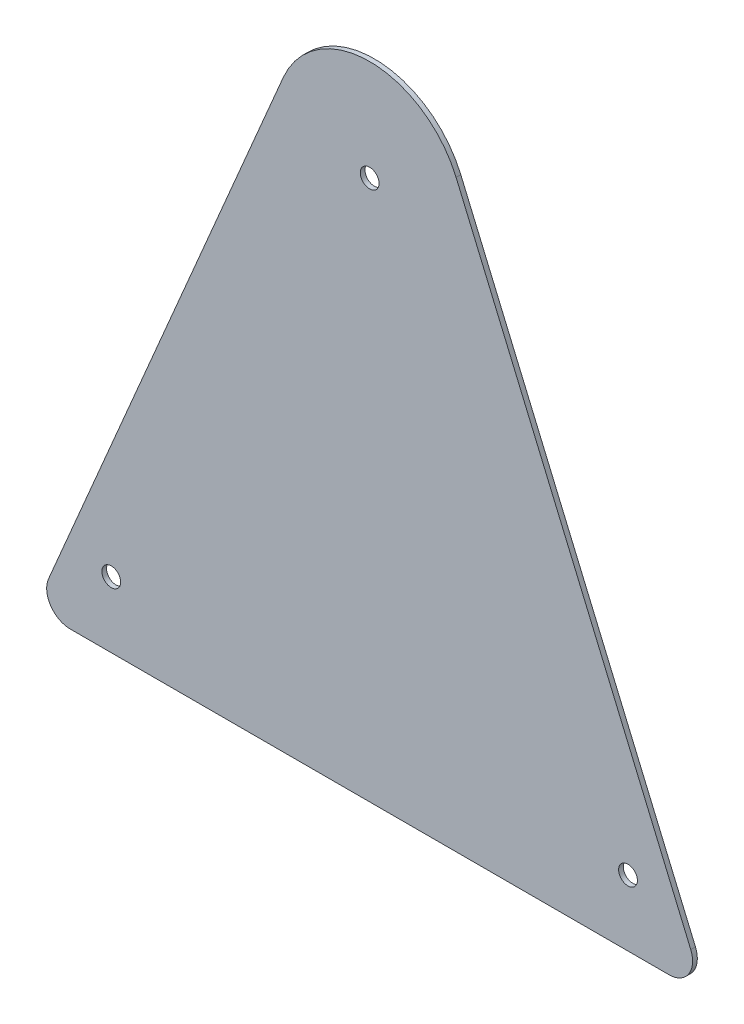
ISO-10303-21;
HEADER;
FILE_DESCRIPTION(('STEP AP214'),'2;1');
FILE_NAME('part.step','',(''),(''),'','','');
FILE_SCHEMA(('AUTOMOTIVE_DESIGN { 1 0 10303 214 1 1 1 1 }'));
ENDSEC;
DATA;
#1=APPLICATION_CONTEXT('core data for automotive mechanical design processes');
#2=APPLICATION_PROTOCOL_DEFINITION('international standard','automotive_design',2000,#1);
#3=PRODUCT_CONTEXT('',#1,'mechanical');
#4=PRODUCT('Part','Part','',(#3));
#5=PRODUCT_RELATED_PRODUCT_CATEGORY('part','',(#4));
#6=PRODUCT_DEFINITION_FORMATION('','',#4);
#7=PRODUCT_DEFINITION_CONTEXT('part definition',#1,'design');
#8=PRODUCT_DEFINITION('design','',#6,#7);
#9=PRODUCT_DEFINITION_SHAPE('','',#8);
#10=(LENGTH_UNIT() NAMED_UNIT(*) SI_UNIT(.MILLI.,.METRE.));
#11=(NAMED_UNIT(*) PLANE_ANGLE_UNIT() SI_UNIT($,.RADIAN.));
#12=(NAMED_UNIT(*) SI_UNIT($,.STERADIAN.) SOLID_ANGLE_UNIT());
#13=UNCERTAINTY_MEASURE_WITH_UNIT(LENGTH_MEASURE(1.E-05),#10,'distance_accuracy_value','');
#14=(GEOMETRIC_REPRESENTATION_CONTEXT(3) GLOBAL_UNCERTAINTY_ASSIGNED_CONTEXT((#13)) GLOBAL_UNIT_ASSIGNED_CONTEXT((#10,
#11,#12)) REPRESENTATION_CONTEXT('',''));
#15=CARTESIAN_POINT('',(0.,0.,0.));
#16=DIRECTION('',(0.,0.,1.));
#17=DIRECTION('',(1.,0.,0.));
#18=AXIS2_PLACEMENT_3D('',#15,#16,#17);
#19=CARTESIAN_POINT('',(-127.5,10.,-1.));
#20=DIRECTION('',(0.,0.,-1.));
#21=DIRECTION('',(-1.,0.,0.));
#22=AXIS2_PLACEMENT_3D('',#19,#20,#21);
#23=PLANE('',#22);
#24=CARTESIAN_POINT('',(-110.,28.0099012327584,-1.));
#25=DIRECTION('',(0.,0.,1.));
#26=DIRECTION('',(1.,0.,0.));
#27=AXIS2_PLACEMENT_3D('',#24,#25,#26);
#28=CIRCLE('',#27,4.00000000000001);
#29=CARTESIAN_POINT('',(-106.,28.0099012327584,-1.));
#30=VERTEX_POINT('',#29);
#31=EDGE_CURVE('E157',#30,#30,#28,.T.);
#32=ORIENTED_EDGE('',*,*,#31,.T.);
#33=EDGE_LOOP('',(#32));
#34=FACE_BOUND('',#33,.T.);
#35=CARTESIAN_POINT('',(-127.5,10.,-1.));
#36=DIRECTION('',(0.,0.,-1.));
#37=DIRECTION('',(-1.,0.,0.));
#38=AXIS2_PLACEMENT_3D('',#35,#36,#37);
#39=CIRCLE('',#38,9.99999999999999);
#40=CARTESIAN_POINT('',(-127.5,0.,-1.));
#41=VERTEX_POINT('',#40);
#42=CARTESIAN_POINT('',(-136.701501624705,13.9156567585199,-1.));
#43=VERTEX_POINT('',#42);
#44=EDGE_CURVE('E84',#41,#43,#39,.T.);
#45=ORIENTED_EDGE('',*,*,#44,.T.);
#46=DIRECTION('',(-0.391565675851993,-0.920150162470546,0.));
#47=VECTOR('',#46,1.);
#48=CARTESIAN_POINT('',(-36.8060064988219,248.66262703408,-1.));
#49=LINE('',#48,#47);
#50=CARTESIAN_POINT('',(-36.8060064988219,248.66262703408,-1.));
#51=VERTEX_POINT('',#50);
#52=EDGE_CURVE('E91',#51,#43,#49,.T.);
#53=ORIENTED_EDGE('',*,*,#52,.F.);
#54=CARTESIAN_POINT('',(0.,233.,-1.));
#55=DIRECTION('',(0.,0.,1.));
#56=DIRECTION('',(1.,0.,0.));
#57=AXIS2_PLACEMENT_3D('',#54,#55,#56);
#58=CIRCLE('',#57,40.);
#59=CARTESIAN_POINT('',(36.8060064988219,248.66262703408,-1.));
#60=VERTEX_POINT('',#59);
#61=EDGE_CURVE('E96',#60,#51,#58,.T.);
#62=ORIENTED_EDGE('',*,*,#61,.F.);
#63=DIRECTION('',(-0.391565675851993,0.920150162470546,0.));
#64=VECTOR('',#63,1.);
#65=CARTESIAN_POINT('',(136.701501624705,13.9156567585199,-1.));
#66=LINE('',#65,#64);
#67=CARTESIAN_POINT('',(136.701501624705,13.9156567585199,-1.));
#68=VERTEX_POINT('',#67);
#69=EDGE_CURVE('E110',#68,#60,#66,.T.);
#70=ORIENTED_EDGE('',*,*,#69,.F.);
#71=CARTESIAN_POINT('',(127.5,10.,-1.));
#72=DIRECTION('',(0.,0.,1.));
#73=DIRECTION('',(1.,0.,0.));
#74=AXIS2_PLACEMENT_3D('',#71,#72,#73);
#75=CIRCLE('',#74,9.99999999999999);
#76=CARTESIAN_POINT('',(127.5,0.,-1.));
#77=VERTEX_POINT('',#76);
#78=EDGE_CURVE('E112',#77,#68,#75,.T.);
#79=ORIENTED_EDGE('',*,*,#78,.F.);
#80=DIRECTION('',(1.,0.,0.));
#81=VECTOR('',#80,1.);
#82=CARTESIAN_POINT('',(-127.5,0.,-1.));
#83=LINE('',#82,#81);
#84=EDGE_CURVE('E101',#41,#77,#83,.T.);
#85=ORIENTED_EDGE('',*,*,#84,.F.);
#86=EDGE_LOOP('',(#45,#53,#62,#70,#79,#85));
#87=FACE_BOUND('',#86,.T.);
#88=CARTESIAN_POINT('',(0.,230.,-1.));
#89=DIRECTION('',(0.,0.,1.));
#90=DIRECTION('',(1.,0.,0.));
#91=AXIS2_PLACEMENT_3D('',#88,#89,#90);
#92=CIRCLE('',#91,4.);
#93=CARTESIAN_POINT('',(4.,230.,-1.));
#94=VERTEX_POINT('',#93);
#95=EDGE_CURVE('E105',#94,#94,#92,.T.);
#96=ORIENTED_EDGE('',*,*,#95,.T.);
#97=EDGE_LOOP('',(#96));
#98=FACE_BOUND('',#97,.T.);
#99=CARTESIAN_POINT('',(110.,28.0099012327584,-1.));
#100=DIRECTION('',(0.,0.,1.));
#101=DIRECTION('',(1.,0.,0.));
#102=AXIS2_PLACEMENT_3D('',#99,#100,#101);
#103=CIRCLE('',#102,4.00000000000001);
#104=CARTESIAN_POINT('',(114.,28.0099012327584,-1.));
#105=VERTEX_POINT('',#104);
#106=EDGE_CURVE('E158',#105,#105,#103,.T.);
#107=ORIENTED_EDGE('',*,*,#106,.T.);
#108=EDGE_LOOP('',(#107));
#109=FACE_BOUND('',#108,.T.);
#110=ADVANCED_FACE('F30',(#34,#87,#98,#109),#23,.T.);
#111=CARTESIAN_POINT('',(-127.5,10.,1.));
#112=DIRECTION('',(0.,0.,-1.));
#113=DIRECTION('',(-1.,0.,0.));
#114=AXIS2_PLACEMENT_3D('',#111,#112,#113);
#115=PLANE('',#114);
#116=CARTESIAN_POINT('',(-110.,28.0099012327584,1.));
#117=DIRECTION('',(0.,0.,1.));
#118=DIRECTION('',(1.,0.,0.));
#119=AXIS2_PLACEMENT_3D('',#116,#117,#118);
#120=CIRCLE('',#119,4.00000000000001);
#121=CARTESIAN_POINT('',(-106.,28.0099012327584,1.));
#122=VERTEX_POINT('',#121);
#123=EDGE_CURVE('E161',#122,#122,#120,.T.);
#124=ORIENTED_EDGE('',*,*,#123,.F.);
#125=EDGE_LOOP('',(#124));
#126=FACE_BOUND('',#125,.T.);
#127=CARTESIAN_POINT('',(-127.5,10.,1.));
#128=DIRECTION('',(0.,0.,-1.));
#129=DIRECTION('',(-1.,0.,0.));
#130=AXIS2_PLACEMENT_3D('',#127,#128,#129);
#131=CIRCLE('',#130,9.99999999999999);
#132=CARTESIAN_POINT('',(-127.5,0.,1.));
#133=VERTEX_POINT('',#132);
#134=CARTESIAN_POINT('',(-136.701501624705,13.9156567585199,1.));
#135=VERTEX_POINT('',#134);
#136=EDGE_CURVE('E85',#133,#135,#131,.T.);
#137=ORIENTED_EDGE('',*,*,#136,.F.);
#138=DIRECTION('',(1.,0.,0.));
#139=VECTOR('',#138,1.);
#140=CARTESIAN_POINT('',(-127.5,0.,1.));
#141=LINE('',#140,#139);
#142=CARTESIAN_POINT('',(127.5,0.,1.));
#143=VERTEX_POINT('',#142);
#144=EDGE_CURVE('E52',#133,#143,#141,.T.);
#145=ORIENTED_EDGE('',*,*,#144,.T.);
#146=CARTESIAN_POINT('',(127.5,10.,1.));
#147=DIRECTION('',(0.,0.,1.));
#148=DIRECTION('',(1.,0.,0.));
#149=AXIS2_PLACEMENT_3D('',#146,#147,#148);
#150=CIRCLE('',#149,9.99999999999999);
#151=CARTESIAN_POINT('',(136.701501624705,13.9156567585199,1.));
#152=VERTEX_POINT('',#151);
#153=EDGE_CURVE('E122',#143,#152,#150,.T.);
#154=ORIENTED_EDGE('',*,*,#153,.T.);
#155=DIRECTION('',(-0.391565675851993,0.920150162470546,0.));
#156=VECTOR('',#155,1.);
#157=CARTESIAN_POINT('',(136.701501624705,13.9156567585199,1.));
#158=LINE('',#157,#156);
#159=CARTESIAN_POINT('',(36.8060064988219,248.66262703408,1.));
#160=VERTEX_POINT('',#159);
#161=EDGE_CURVE('E120',#152,#160,#158,.T.);
#162=ORIENTED_EDGE('',*,*,#161,.T.);
#163=CARTESIAN_POINT('',(0.,233.,1.));
#164=DIRECTION('',(0.,0.,1.));
#165=DIRECTION('',(1.,0.,0.));
#166=AXIS2_PLACEMENT_3D('',#163,#164,#165);
#167=CIRCLE('',#166,40.);
#168=CARTESIAN_POINT('',(-36.8060064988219,248.66262703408,1.));
#169=VERTEX_POINT('',#168);
#170=EDGE_CURVE('E118',#160,#169,#167,.T.);
#171=ORIENTED_EDGE('',*,*,#170,.T.);
#172=DIRECTION('',(-0.391565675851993,-0.920150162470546,0.));
#173=VECTOR('',#172,1.);
#174=CARTESIAN_POINT('',(-36.8060064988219,248.66262703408,1.));
#175=LINE('',#174,#173);
#176=EDGE_CURVE('E116',#169,#135,#175,.T.);
#177=ORIENTED_EDGE('',*,*,#176,.T.);
#178=EDGE_LOOP('',(#137,#145,#154,#162,#171,#177));
#179=FACE_BOUND('',#178,.T.);
#180=CARTESIAN_POINT('',(0.,230.,1.));
#181=DIRECTION('',(0.,0.,1.));
#182=DIRECTION('',(1.,0.,0.));
#183=AXIS2_PLACEMENT_3D('',#180,#181,#182);
#184=CIRCLE('',#183,4.);
#185=CARTESIAN_POINT('',(4.,230.,1.));
#186=VERTEX_POINT('',#185);
#187=EDGE_CURVE('E102',#186,#186,#184,.T.);
#188=ORIENTED_EDGE('',*,*,#187,.F.);
#189=EDGE_LOOP('',(#188));
#190=FACE_BOUND('',#189,.T.);
#191=CARTESIAN_POINT('',(110.,28.0099012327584,1.));
#192=DIRECTION('',(0.,0.,1.));
#193=DIRECTION('',(1.,0.,0.));
#194=AXIS2_PLACEMENT_3D('',#191,#192,#193);
#195=CIRCLE('',#194,4.00000000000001);
#196=CARTESIAN_POINT('',(114.,28.0099012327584,1.));
#197=VERTEX_POINT('',#196);
#198=EDGE_CURVE('E155',#197,#197,#195,.T.);
#199=ORIENTED_EDGE('',*,*,#198,.F.);
#200=EDGE_LOOP('',(#199));
#201=FACE_BOUND('',#200,.T.);
#202=ADVANCED_FACE('F146',(#126,#179,#190,#201),#115,.F.);
#203=CARTESIAN_POINT('',(-127.5,10.,1.));
#204=DIRECTION('',(0.,0.,-1.));
#205=DIRECTION('',(-1.,0.,0.));
#206=AXIS2_PLACEMENT_3D('',#203,#204,#205);
#207=CYLINDRICAL_SURFACE('',#206,9.99999999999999);
#208=ORIENTED_EDGE('',*,*,#44,.F.);
#209=DIRECTION('',(0.,0.,-1.));
#210=VECTOR('',#209,1.);
#211=CARTESIAN_POINT('',(-127.5,0.,1.));
#212=LINE('',#211,#210);
#213=EDGE_CURVE('E11',#133,#41,#212,.T.);
#214=ORIENTED_EDGE('',*,*,#213,.F.);
#215=ORIENTED_EDGE('',*,*,#136,.T.);
#216=DIRECTION('',(0.,0.,-1.));
#217=VECTOR('',#216,1.);
#218=CARTESIAN_POINT('',(-136.701501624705,13.9156567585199,1.));
#219=LINE('',#218,#217);
#220=EDGE_CURVE('E34',#135,#43,#219,.T.);
#221=ORIENTED_EDGE('',*,*,#220,.T.);
#222=EDGE_LOOP('',(#208,#214,#215,#221));
#223=FACE_BOUND('',#222,.T.);
#224=ADVANCED_FACE('F32',(#223),#207,.T.);
#225=CARTESIAN_POINT('',(-127.5,0.,1.));
#226=DIRECTION('',(0.,1.,0.));
#227=DIRECTION('',(0.,0.,1.));
#228=AXIS2_PLACEMENT_3D('',#225,#226,#227);
#229=PLANE('',#228);
#230=ORIENTED_EDGE('',*,*,#84,.T.);
#231=DIRECTION('',(0.,0.,-1.));
#232=VECTOR('',#231,1.);
#233=CARTESIAN_POINT('',(127.5,0.,1.));
#234=LINE('',#233,#232);
#235=EDGE_CURVE('E39',#143,#77,#234,.T.);
#236=ORIENTED_EDGE('',*,*,#235,.F.);
#237=ORIENTED_EDGE('',*,*,#144,.F.);
#238=ORIENTED_EDGE('',*,*,#213,.T.);
#239=EDGE_LOOP('',(#230,#236,#237,#238));
#240=FACE_BOUND('',#239,.T.);
#241=ADVANCED_FACE('F145',(#240),#229,.F.);
#242=CARTESIAN_POINT('',(127.5,10.,1.));
#243=DIRECTION('',(0.,0.,-1.));
#244=DIRECTION('',(-1.,0.,0.));
#245=AXIS2_PLACEMENT_3D('',#242,#243,#244);
#246=CYLINDRICAL_SURFACE('',#245,9.99999999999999);
#247=ORIENTED_EDGE('',*,*,#78,.T.);
#248=DIRECTION('',(0.,0.,-1.));
#249=VECTOR('',#248,1.);
#250=CARTESIAN_POINT('',(136.701501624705,13.9156567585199,1.));
#251=LINE('',#250,#249);
#252=EDGE_CURVE('E127',#152,#68,#251,.T.);
#253=ORIENTED_EDGE('',*,*,#252,.F.);
#254=ORIENTED_EDGE('',*,*,#153,.F.);
#255=ORIENTED_EDGE('',*,*,#235,.T.);
#256=EDGE_LOOP('',(#247,#253,#254,#255));
#257=FACE_BOUND('',#256,.T.);
#258=ADVANCED_FACE('F143',(#257),#246,.T.);
#259=CARTESIAN_POINT('',(136.701501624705,13.9156567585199,1.));
#260=DIRECTION('',(-0.920150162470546,-0.391565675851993,0.));
#261=DIRECTION('',(0.391565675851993,-0.920150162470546,0.));
#262=AXIS2_PLACEMENT_3D('',#259,#260,#261);
#263=PLANE('',#262);
#264=ORIENTED_EDGE('',*,*,#69,.T.);
#265=DIRECTION('',(0.,0.,-1.));
#266=VECTOR('',#265,1.);
#267=CARTESIAN_POINT('',(36.8060064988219,248.66262703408,1.));
#268=LINE('',#267,#266);
#269=EDGE_CURVE('E130',#160,#60,#268,.T.);
#270=ORIENTED_EDGE('',*,*,#269,.F.);
#271=ORIENTED_EDGE('',*,*,#161,.F.);
#272=ORIENTED_EDGE('',*,*,#252,.T.);
#273=EDGE_LOOP('',(#264,#270,#271,#272));
#274=FACE_BOUND('',#273,.T.);
#275=ADVANCED_FACE('F139',(#274),#263,.F.);
#276=CARTESIAN_POINT('',(0.,233.,1.));
#277=DIRECTION('',(0.,0.,-1.));
#278=DIRECTION('',(-1.,0.,0.));
#279=AXIS2_PLACEMENT_3D('',#276,#277,#278);
#280=CYLINDRICAL_SURFACE('',#279,40.);
#281=ORIENTED_EDGE('',*,*,#61,.T.);
#282=DIRECTION('',(0.,0.,-1.));
#283=VECTOR('',#282,1.);
#284=CARTESIAN_POINT('',(-36.8060064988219,248.66262703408,1.));
#285=LINE('',#284,#283);
#286=EDGE_CURVE('E88',#169,#51,#285,.T.);
#287=ORIENTED_EDGE('',*,*,#286,.F.);
#288=ORIENTED_EDGE('',*,*,#170,.F.);
#289=ORIENTED_EDGE('',*,*,#269,.T.);
#290=EDGE_LOOP('',(#281,#287,#288,#289));
#291=FACE_BOUND('',#290,.T.);
#292=ADVANCED_FACE('F135',(#291),#280,.T.);
#293=CARTESIAN_POINT('',(-36.8060064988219,248.66262703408,1.));
#294=DIRECTION('',(0.920150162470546,-0.391565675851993,0.));
#295=DIRECTION('',(0.391565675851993,0.920150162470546,0.));
#296=AXIS2_PLACEMENT_3D('',#293,#294,#295);
#297=PLANE('',#296);
#298=ORIENTED_EDGE('',*,*,#52,.T.);
#299=ORIENTED_EDGE('',*,*,#220,.F.);
#300=ORIENTED_EDGE('',*,*,#176,.F.);
#301=ORIENTED_EDGE('',*,*,#286,.T.);
#302=EDGE_LOOP('',(#298,#299,#300,#301));
#303=FACE_BOUND('',#302,.T.);
#304=ADVANCED_FACE('F92',(#303),#297,.F.);
#305=CARTESIAN_POINT('',(0.,230.,1.));
#306=DIRECTION('',(0.,0.,-1.));
#307=DIRECTION('',(-1.,0.,0.));
#308=AXIS2_PLACEMENT_3D('',#305,#306,#307);
#309=CYLINDRICAL_SURFACE('',#308,4.);
#310=ORIENTED_EDGE('',*,*,#187,.T.);
#311=EDGE_LOOP('',(#310));
#312=FACE_BOUND('',#311,.T.);
#313=ORIENTED_EDGE('',*,*,#95,.F.);
#314=EDGE_LOOP('',(#313));
#315=FACE_BOUND('',#314,.T.);
#316=ADVANCED_FACE('F171',(#312,#315),#309,.F.);
#317=CARTESIAN_POINT('',(-110.,28.0099012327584,1.));
#318=DIRECTION('',(0.,0.,-1.));
#319=DIRECTION('',(-1.,0.,0.));
#320=AXIS2_PLACEMENT_3D('',#317,#318,#319);
#321=CYLINDRICAL_SURFACE('',#320,4.00000000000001);
#322=ORIENTED_EDGE('',*,*,#123,.T.);
#323=EDGE_LOOP('',(#322));
#324=FACE_BOUND('',#323,.T.);
#325=ORIENTED_EDGE('',*,*,#31,.F.);
#326=EDGE_LOOP('',(#325));
#327=FACE_BOUND('',#326,.T.);
#328=ADVANCED_FACE('F173',(#324,#327),#321,.F.);
#329=CARTESIAN_POINT('',(110.,28.0099012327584,1.));
#330=DIRECTION('',(0.,0.,-1.));
#331=DIRECTION('',(-1.,0.,0.));
#332=AXIS2_PLACEMENT_3D('',#329,#330,#331);
#333=CYLINDRICAL_SURFACE('',#332,4.00000000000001);
#334=ORIENTED_EDGE('',*,*,#198,.T.);
#335=EDGE_LOOP('',(#334));
#336=FACE_BOUND('',#335,.T.);
#337=ORIENTED_EDGE('',*,*,#106,.F.);
#338=EDGE_LOOP('',(#337));
#339=FACE_BOUND('',#338,.T.);
#340=ADVANCED_FACE('F180',(#336,#339),#333,.F.);
#341=CLOSED_SHELL('',(#110,#202,#224,#241,#258,#275,#292,#304,#316,#328,#340));
#342=MANIFOLD_SOLID_BREP('B2',#341);
#343=ADVANCED_BREP_SHAPE_REPRESENTATION('',(#18,#342),#14);
#344=SHAPE_DEFINITION_REPRESENTATION(#9,#343);
ENDSEC;
END-ISO-10303-21;
